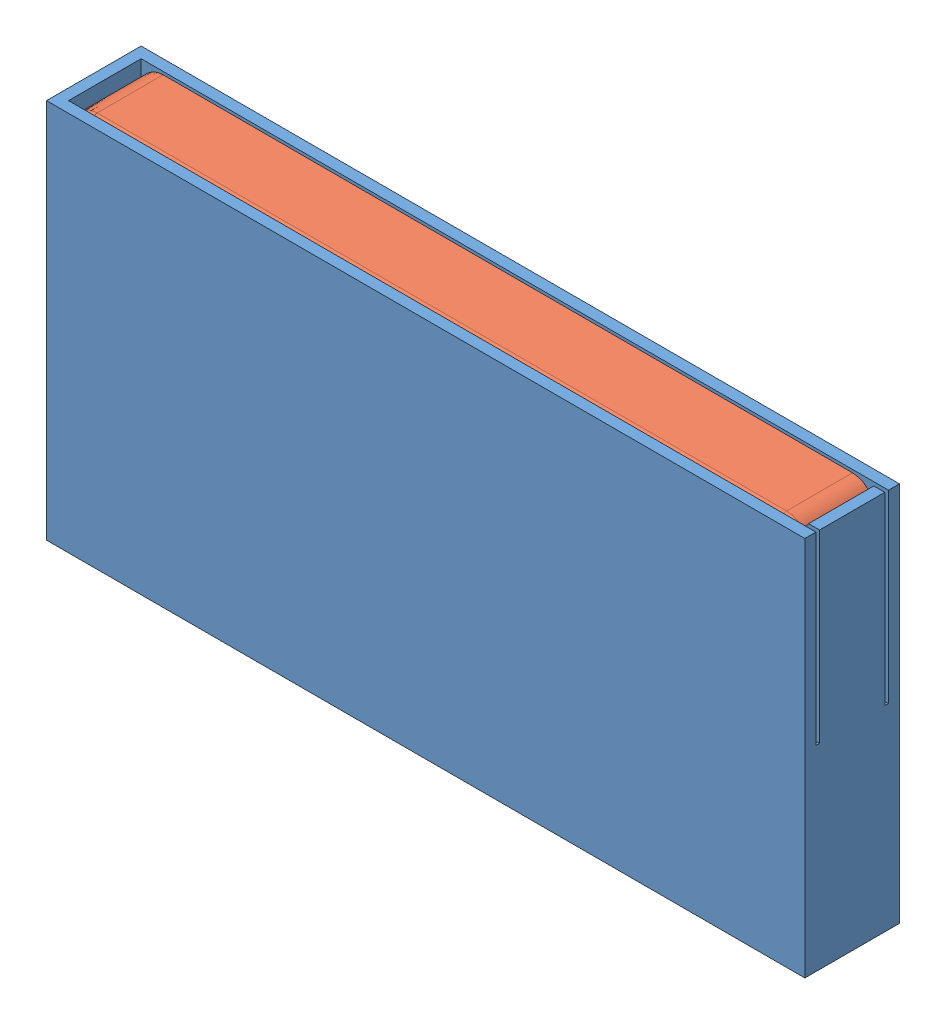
SolidWorks assembly Assem1.sldasm, configuration Default (file format 6000). Lengths in mm.
Overall size (103.4 51.9 12.9).
2 component instances, 2 part files, 3 mates.
Components (placement in the parent):
- drillbitbox_case-1: drillbitbox_case.SLDPRT [Default] at (-174.4589 -7.9603 60.0254) size (103.4 51.9 12.9)
- drillbitbox_drawer-1: drillbitbox_drawer.SLDPRT [Default] at (-172.7589 -7.7603 48.8254) x (1 0 0) z (0 -1 0) size (100 9.5 50)
Mates (geometry in assembly coordinates):
- Distance1: distance = 0.2 mm: plane of drillbitbox_drawer-1 through (-172.7589 -7.7603 48.8254) normal (0 0 -1); plane of drillbitbox_case-1 through (-172.9589 42.4397 48.6254) normal (0 0 1)
- Distance2: distance = 0.2 mm: plane of drillbitbox_drawer-1 through (-72.7589 -7.7603 50.3254) normal (1 0 0); plane of drillbitbox_case-1 through (-72.5589 42.4397 58.5254) normal (-1 0 0)
- Distance3: distance = 0.2 mm anti-aligned: plane of drillbitbox_drawer-1 through (-172.7589 -7.7603 50.3254) normal (0 -1 0); plane of drillbitbox_case-1 through (-174.4589 -7.9603 60.0254) normal (0 1 0)
